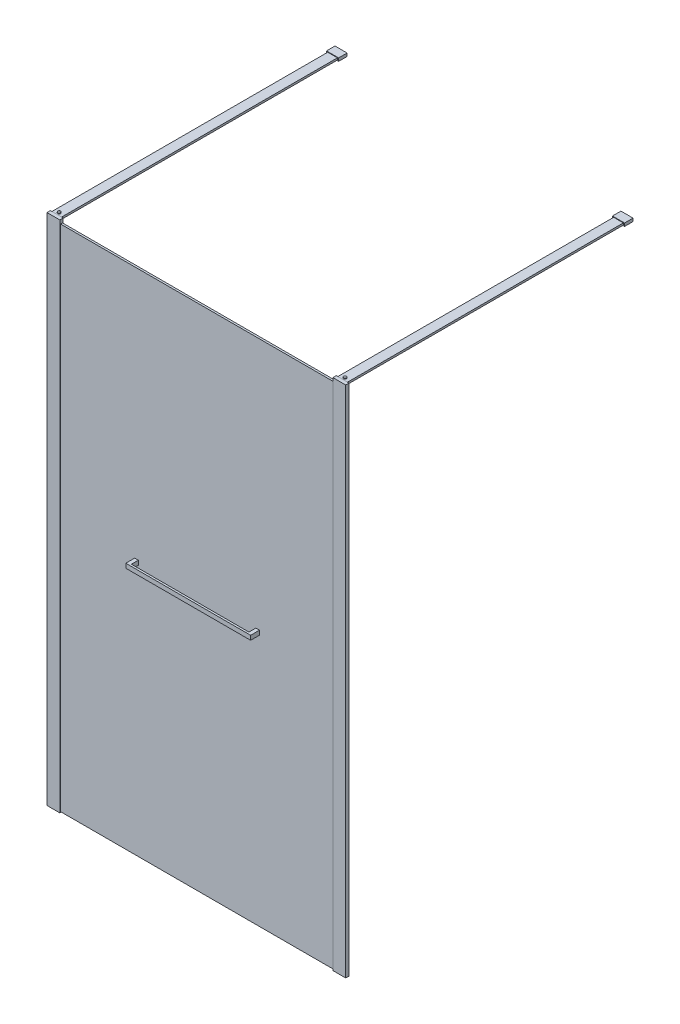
from build123d import *

# Parameters (mm, degrees)
DODANIE_WYCI_GNI_CIE1_START         = 3
DODANIE_WYCI_GNI_CIE1_DEPTH         = 2100
SZKIC2_W                            = 1147
SZKIC2_H                            = 8
DODANIE_WYCI_GNI_CIE2_DEPTH         = 2100
DODANIE_WYCI_GNI_CIE3_DEPTH         = 2100
SZKIC4_W                            = 53
SZKIC4_H                            = 14
DODANIE_WYCI_GNI_CIE4_DEPTH         = 16
SZKIC5_W                            = 53
SZKIC5_H                            = 14
DODANIE_WYCI_GNI_CIE5_DEPTH         = 16
SZKIC7_W                            = 53
SZKIC7_H                            = 14
DODANIE_WYCI_GNI_CIE7_DEPTH         = 3
SZKIC8_W                            = 53
SZKIC8_H                            = 14
DODANIE_WYCI_GNI_CIE8_DEPTH         = 3
SZKIC9_W                            = 40
SZKIC9_H                            = 8
DODANIE_WYCI_GNI_CIE9_DEPTH         = 1170
DODANIE_WYCI_GNI_CIE9_2_DEPTH       = 1170
DODANIE_WYCI_GNI_CIE10_START        = -32
SZKIC10_W                           = 50
SZKIC10_H                           = 12.5
DODANIE_WYCI_GNI_CIE10_DEPTH        = 35
DODANIE_WYCI_GNI_CIE11_DEPTH        = 36.5
DODANIE_WYCI_GNI_CIE11_DEPTH_BACK   = 18
SZKIC12_W                           = 15
SZKIC12_H                           = 18
DODANIE_WYCI_GNI_CIE11_2_DEPTH      = 36.5
DODANIE_WYCI_GNI_CIE11_2_DEPTH_BACK = 18
SZKIC13_W                           = 8
SZKIC13_H                           = 18
DODANIE_WYCI_GNI_CIE12_DEPTH        = 485


with BuildPart() as part:
    # Szkic1 → Dodanie-wyci_gni_cie1 (new body)
    with BuildSketch(Plane(origin=(0, 0, 0), x_dir=(1, 0, 0), z_dir=(0, 1, 0)).offset(DODANIE_WYCI_GNI_CIE1_START)):
        Polygon((0, 0), (0, 14), (53, 14), (53, 11), (42.9, 11), (42.9, 3), (53, 3), (53, 0), align=None)
    extrude(amount=DODANIE_WYCI_GNI_CIE1_DEPTH)

    # Szkic4 → Dodanie-wyci_gni_cie4 (add)
    with BuildSketch(Plane(origin=(0, 2103, 0), x_dir=(1, 0, 0), z_dir=(0, 1, 0))):
        with Locations((26.5, 7)):
            Rectangle(SZKIC4_W, SZKIC4_H)
    extrude(amount=DODANIE_WYCI_GNI_CIE4_DEPTH)

    # Szkic8 → Dodanie-wyci_gni_cie8 (add)
    with BuildSketch(Plane.XZ.offset(-3)):
        with Locations((26.5, -7)):
            Rectangle(SZKIC8_W, SZKIC8_H)
    extrude(amount=DODANIE_WYCI_GNI_CIE8_DEPTH)


with BuildPart() as body_2:
    # Szkic2 → Dodanie-wyci_gni_cie2 (new body)
    with BuildSketch(Plane.XZ.offset(-3)):
        with Locations((616.4, -7)):
            Rectangle(SZKIC2_W, SZKIC2_H)
    extrude(amount=-DODANIE_WYCI_GNI_CIE2_DEPTH)


with BuildPart() as body_3:
    # Szkic3 → Dodanie-wyci_gni_cie3 (new body)
    with BuildSketch(Plane.XZ.offset(-3)):
        Polygon((1179.8, -3), (1179.8, 0), (1232.8, 0), (1232.8, -14), (1179.8, -14), (1179.8, -11), (1189.9, -11), (1189.9, -3), align=None)
    extrude(amount=-DODANIE_WYCI_GNI_CIE3_DEPTH)

    # Szkic5 → Dodanie-wyci_gni_cie5 (add)
    with BuildSketch(Plane(origin=(0, 2103, 0), x_dir=(1, 0, 0), z_dir=(0, 1, 0))):
        with Locations((1206.3, 7)):
            Rectangle(SZKIC5_W, SZKIC5_H)
    extrude(amount=DODANIE_WYCI_GNI_CIE5_DEPTH)

    # Szkic7 → Dodanie-wyci_gni_cie7 (add)
    with BuildSketch(Plane.XZ.offset(-3)):
        with Locations((1206.3, -7)):
            Rectangle(SZKIC7_W, SZKIC7_H)
    extrude(amount=DODANIE_WYCI_GNI_CIE7_DEPTH)


with BuildPart() as body_4:
    # Szkic9 → Dodanie-wyci_gni_cie9 (new body)
    with BuildSketch(Plane(origin=(0, 0, -14), x_dir=(-1, 0, 0), z_dir=(0, 0, -1))):
        with Locations((-1206.3, 2115)):
            Rectangle(SZKIC9_W, SZKIC9_H)
    extrude(amount=DODANIE_WYCI_GNI_CIE9_DEPTH)



with BuildPart() as body_5:
    # Szkic9 → Dodanie-wyci_gni_cie9 2 (new body)
    with BuildSketch(Plane(origin=(0, 0, -14), x_dir=(-1, 0, 0), z_dir=(0, 0, -1))):
        with Locations((-26.5, 2115)):
            Rectangle(SZKIC9_W, SZKIC9_H)
    extrude(amount=DODANIE_WYCI_GNI_CIE9_2_DEPTH)


with BuildPart() as body_4_1:
    add(body_4.part)

    add(body_5.part)  # Dodanie-wyci_gni_cie10 merges body 5
    # Szkic10 → Dodanie-wyci_gni_cie10 (add)
    with BuildSketch(Plane(origin=(0, 0, -1184), x_dir=(-1, 0, 0), z_dir=(0, 0, -1)).offset(DODANIE_WYCI_GNI_CIE10_START)):
        with Locations((-1206.3, 2115)):
            Rectangle(SZKIC10_W, SZKIC10_H)
        with Locations((-26.5, 2115)):
            Rectangle(SZKIC10_W, SZKIC10_H)
    extrude(amount=DODANIE_WYCI_GNI_CIE10_DEPTH)

    # Szkic11 → Obr_t1 (revolve)
    with BuildSketch(Plane(origin=(1206.3, 0, 0), x_dir=(0, 0, -1), z_dir=(1, 0, 0))):
        with BuildLine():
            Line((29.9, 2119), (29.65, 2122.8))
            ThreePointArc((29.65, 2122.8), (26.98045718, 2124.212280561), (24, 2124.7))
            Line((24, 2124.7), (24, 2124.2))
            ThreePointArc((24, 2124.2), (26.713886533, 2123.773650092), (29.166308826, 2122.535676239))
            Line((29.166308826, 2122.535676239), (29.398919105, 2119))
            Line((29.398919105, 2119), (29.9, 2119))
        make_face()
    revolve(axis=Axis((1206.3, 2119, -24), (0, 1, 0)))

    # Szkic14 → Obr_t2 (revolve)
    with BuildSketch(Plane(origin=(26.5, 0, 0), x_dir=(0, 0, -1), z_dir=(1, 0, 0))):
        with BuildLine():
            Line((29.9, 2119), (29.65, 2122.8))
            ThreePointArc((29.65, 2122.8), (26.98045718, 2124.212280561), (24, 2124.7))
            Line((24, 2124.7), (24, 2124.2))
            ThreePointArc((24, 2124.2), (26.713886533, 2123.773650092), (29.166308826, 2122.535676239))
            Line((29.166308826, 2122.535676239), (29.398919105, 2119))
            Line((29.398919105, 2119), (29.9, 2119))
        make_face()
    revolve(axis=Axis((26.5, 2119, -24), (0, 1, 0)))


with BuildPart() as body_5_2:
    # Szkic12 → Dodanie-wyci_gni_cie11 (new, two sides: drawn at the far end of the back side and taken through both)
    with BuildSketch(Plane.XY.offset(-3).offset(-DODANIE_WYCI_GNI_CIE11_DEPTH_BACK)):
        with Locations((366.4, 1053)):
            Rectangle(SZKIC12_W, SZKIC12_H)
    extrude(amount=DODANIE_WYCI_GNI_CIE11_DEPTH + DODANIE_WYCI_GNI_CIE11_DEPTH_BACK)



with BuildPart() as body_6:
    # Szkic12 → Dodanie-wyci_gni_cie11 2 (new, two sides: drawn at the far end of the back side and taken through both)
    with BuildSketch(Plane.XY.offset(-3).offset(-DODANIE_WYCI_GNI_CIE11_2_DEPTH_BACK)):
        with Locations((866.4, 1053)):
            Rectangle(SZKIC12_W, SZKIC12_H)
    extrude(amount=DODANIE_WYCI_GNI_CIE11_2_DEPTH + DODANIE_WYCI_GNI_CIE11_2_DEPTH_BACK)


with BuildPart() as body_5_2_1:
    add(body_5_2.part)

    add(body_6.part)  # Dodanie-wyci_gni_cie12 merges body 6
    # Szkic13 → Dodanie-wyci_gni_cie12 (add)
    with BuildSketch(Plane(origin=(373.9, 0, 0), x_dir=(0, 0, -1), z_dir=(1, 0, 0))):
        with Locations((-29.5, 1053)):
            Rectangle(SZKIC13_W, SZKIC13_H)
    extrude(amount=DODANIE_WYCI_GNI_CIE12_DEPTH)


solid = Compound([part.part, body_2.part, body_3.part, body_4_1.part, body_5_2_1.part])
